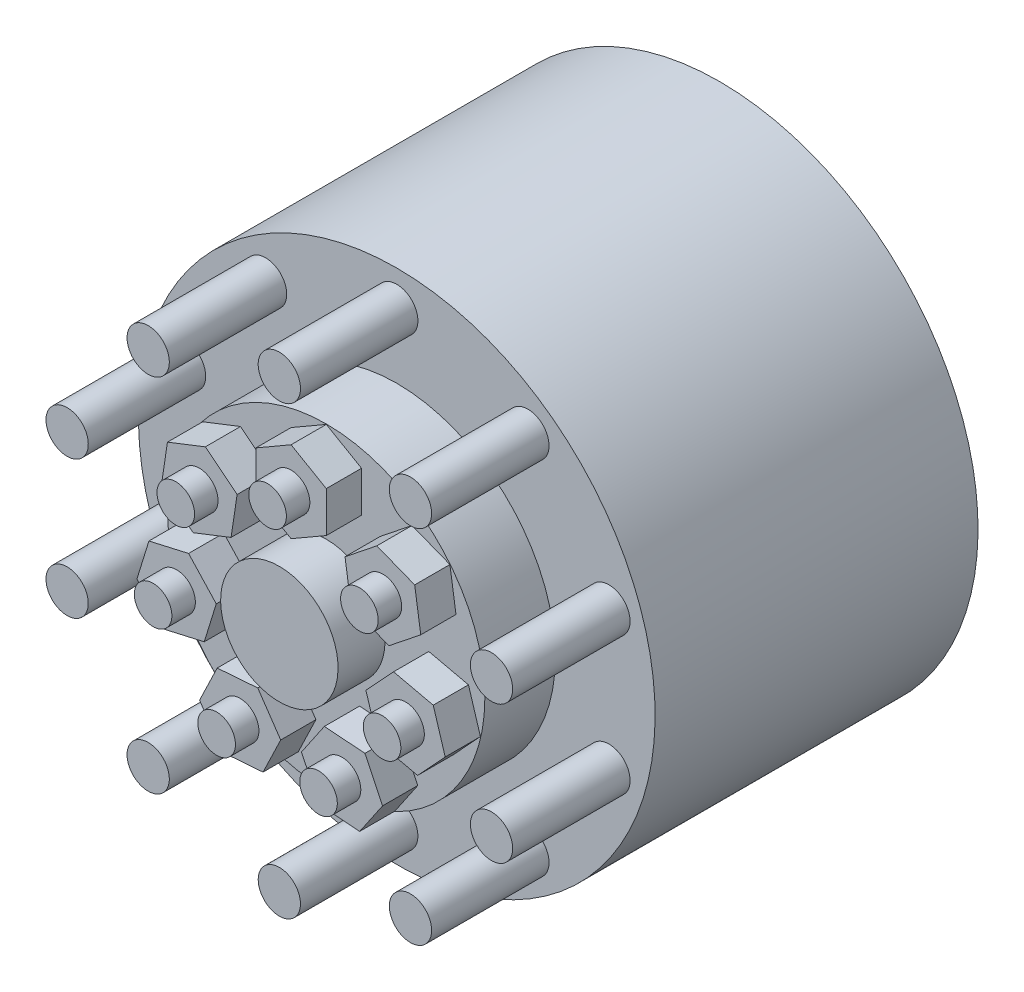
from build123d import *

# Parameters (mm, degrees)
SKETCH3_R           = 18
BOSS_EXTRUDE1_DEPTH = 100
CIRPATTERN1_COUNT   = 10
SKETCH6_R           = 80
CUT_EXTRUDE1_DEPTH  = 50
SKETCH4_R           = 16
BOSS_EXTRUDE2_DEPTH = 50
BOSS_EXTRUDE3_DEPTH = 30
CIRPATTERN2_COUNT   = 7


with BuildPart() as part:
    # Sketch2 → Revolve1 (revolve)
    with BuildSketch(Plane(origin=(0, 0, 0), x_dir=(0, 0, -1), z_dir=(1, 0, 0))):
        Polygon((-375, 0), (-375, 50), (-335, 50), (-335, 135), (-275, 135), (-275, 220), (0, 220), (0, 0), align=None)
    revolve(axis=Axis((0, 0, 0), (0, 0, 1)))

    # Sketch3 → Boss-Extrude1 (add)
    with BuildSketch(Plane.XY.offset(275)):
        with Locations((0, 190)):
            Circle(SKETCH3_R)
    boss_extrude1 = extrude(amount=BOSS_EXTRUDE1_DEPTH)

    # CirPattern1: Boss-Extrude1 ×10 about axis
    cirpattern1_axis = Axis((0, 0, 0), (0, 0, 1))
    for i in range(1, CIRPATTERN1_COUNT):
        add(boss_extrude1.rotate(cirpattern1_axis, i * 360 / CIRPATTERN1_COUNT))

    # Sketch6 → Cut-Extrude1 (cut)
    with BuildSketch(Plane(origin=(0, 0, 0), x_dir=(-1, 0, 0), z_dir=(0, 0, -1))):
        with Locations(Location((0, 0, 0), (0, 0, 90))):
            Circle(SKETCH6_R)
    extrude(amount=-CUT_EXTRUDE1_DEPTH, mode=Mode.SUBTRACT)

    # Sketch4 → Boss-Extrude2 (add)
    with BuildSketch(Plane.XY.offset(335)):
        with Locations((0, 100)):
            Circle(SKETCH4_R)
    boss_extrude2 = extrude(amount=BOSS_EXTRUDE2_DEPTH)

    # Sketch9 → Boss-Extrude3 (add)
    with BuildSketch(Plane.XY.offset(335)):
        Polygon((30, 117.320508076), (0, 134.641016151), (-30, 117.320508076), (-30, 82.679491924), (0, 65.358983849), (30, 82.679491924), align=None)
    boss_extrude3 = extrude(amount=BOSS_EXTRUDE3_DEPTH)

    # CirPattern2: Boss-Extrude2, Boss-Extrude3 ×7 about axis
    cirpattern2_axis = Axis((0, 0, 0), (0, 0, 1))
    add([boss_extrude2.rotate(cirpattern2_axis, i * 360 / CIRPATTERN2_COUNT) for i in range(1, CIRPATTERN2_COUNT)])
    add([boss_extrude3.rotate(cirpattern2_axis, i * 360 / CIRPATTERN2_COUNT) for i in range(1, CIRPATTERN2_COUNT)])


solid = part.part
